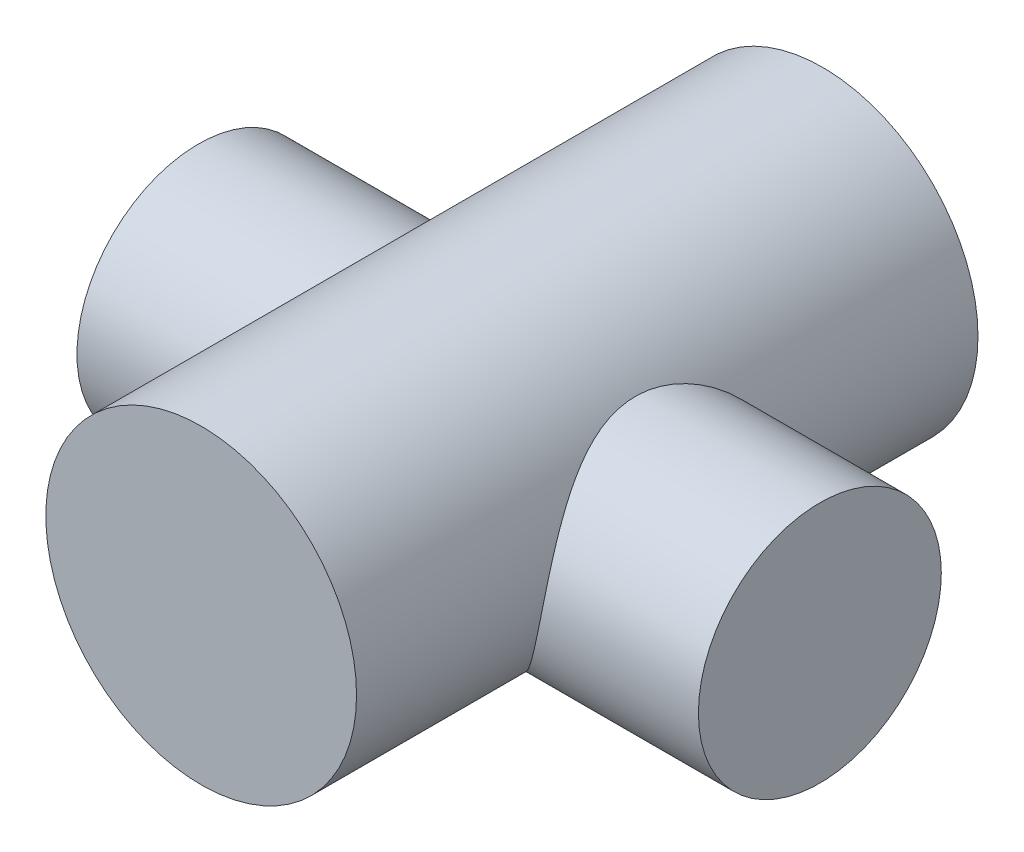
from build123d import *

# Parameters (mm, degrees)
SKETCH_1_R      = 10
EXTRUDE_1_DEPTH = 40
SKETCH_2_R      = 7.817357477
EXTRUDE_2_DEPTH = 20


with BuildPart() as part:
    # Sketch 1 → Extrude 1 (new body)
    with BuildSketch(Plane.XY):
        Circle(SKETCH_1_R)
    extrude(amount=EXTRUDE_1_DEPTH)

    # Sketch 2 → Extrude 2 (add, symmetric)
    with BuildSketch(Plane(origin=(0, 0, 0), x_dir=(0, 0, -1), z_dir=(1, 0, 0))):
        with Locations(Location((-20.178253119, -2, 0), (0, 0, 180))):
            Circle(SKETCH_2_R)
    extrude(amount=EXTRUDE_2_DEPTH, both=True)


solid = part.part
